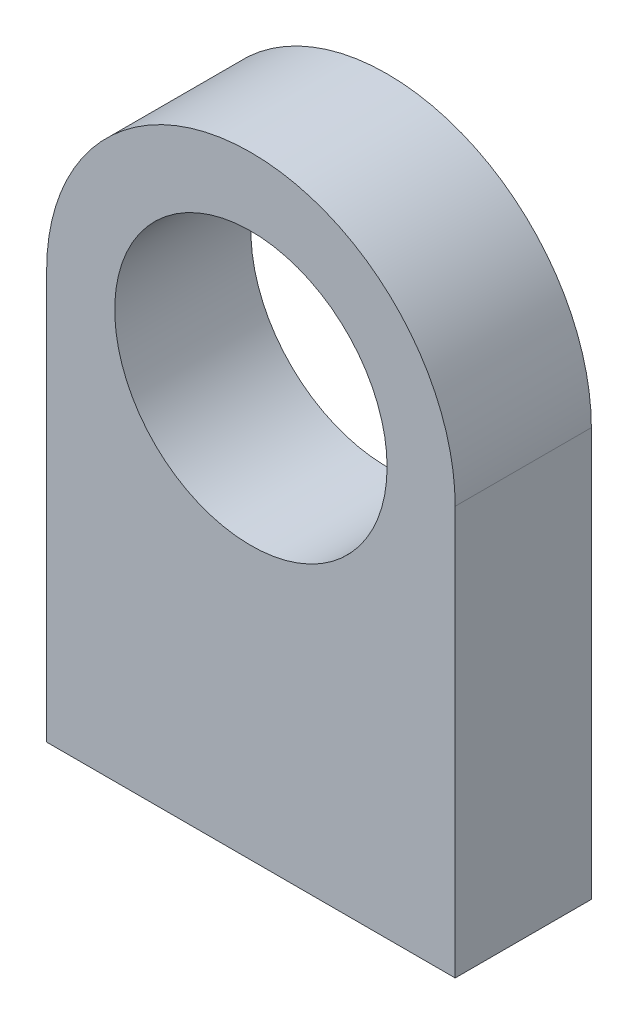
from build123d import *

# Parameters (mm, degrees)
BOSS_EXTRUDE1_DEPTH = 10
SKETCH2_R           = 10
CUT_EXTRUDE1_DEPTH  = 36


with BuildPart() as part:
    # Sketch1 → Boss-Extrude1 (new body)
    with BuildSketch(Plane.XY):
        with BuildLine():
            Line((-15, 0), (-15, -30))
            Line((-15, -30), (15, -30))
            Line((15, -30), (15, 0))
            ThreePointArc((15, 0), (0, 15), (-15, 0))
        make_face()
    extrude(amount=BOSS_EXTRUDE1_DEPTH)

    # Sketch2 → Cut-Extrude1 (cut, through all)
    with BuildSketch(Plane.XY.offset(10)):
        Circle(SKETCH2_R)
    extrude(amount=-CUT_EXTRUDE1_DEPTH, mode=Mode.SUBTRACT)


solid = part.part
